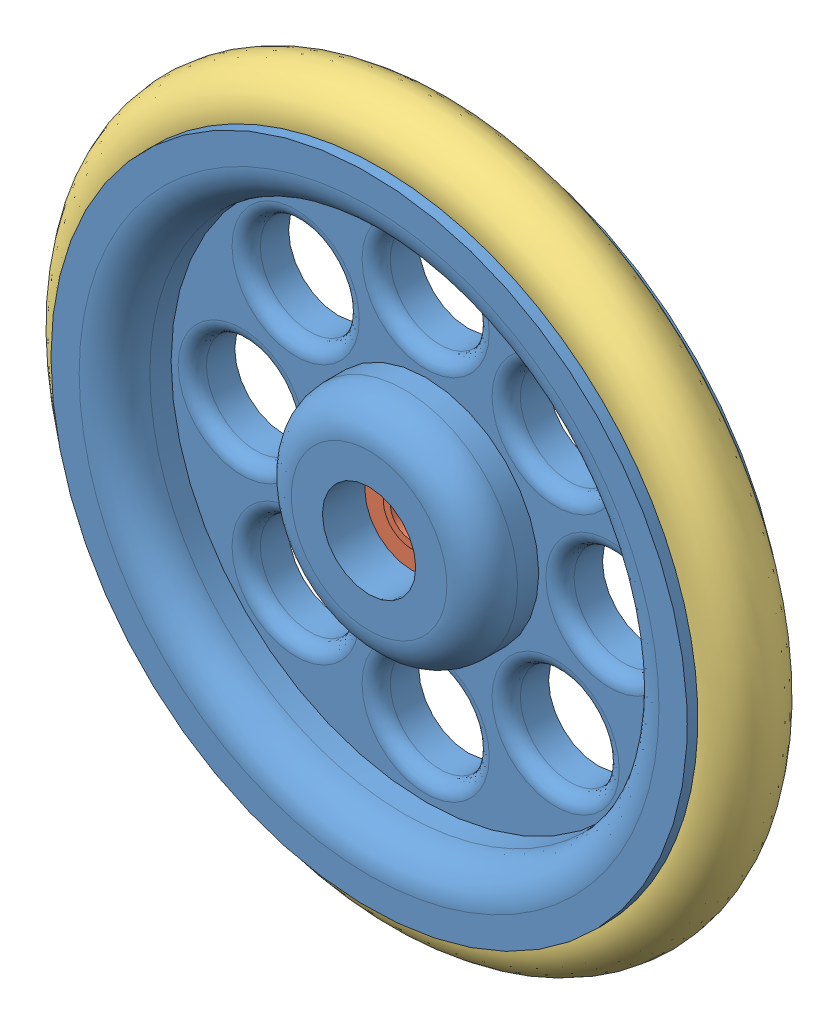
SolidWorks assembly Roue avant.SLDASM, configuration Défaut (file format 8000). Lengths in mm.
Overall size (65.14 65.14 7).
3 component instances, 3 part files, 3 mates.
Components (placement in the parent):
- Roue 48 Direction-1: Roue 48 Direction.SLDPRT [Défaut] at (-6.7993 1.2677 41.5) size (45 45 7)
- Roulement 10x3-1: Roulement 10x3.SLDPRT [Défaut] at (-6.7993 1.2677 45.5) x (0 0 -1) z (1 0 0) size (4 10 10)
- Pneu 48-1: Pneu 48.SLDPRT [Défaut] at (-6.7993 1.2677 44.9688) x (0.936362 -0.351036 0) z (0 0 1) size (50.6 50.6 5.2)
Mates (geometry in assembly coordinates):
- Coïncidente1: coincident anti-aligned: axis of Roue 48 Direction-1 through (-6.7993 1.2677 57.7754) axis (0 0 -1); axis of Roulement 10x3-1 through (-6.7993 1.2677 41.5) axis (0 0 1)
- Coïncidente2: coincident anti-aligned: plane of Roue 48 Direction-1 through (-6.7993 1.2677 45.5) normal (0 0 -1); plane of Roulement 10x3-1 through (-6.7993 1.2677 45.5) normal (0 0 1)
- Coïncidente3: coincident anti-aligned: axis of Roue 48 Direction-1 through (-6.7993 1.2677 57.7754) axis (0 0 -1); axis of Pneu 48-1 through (-6.7993 1.2677 30.6192) axis (0 0 1)
